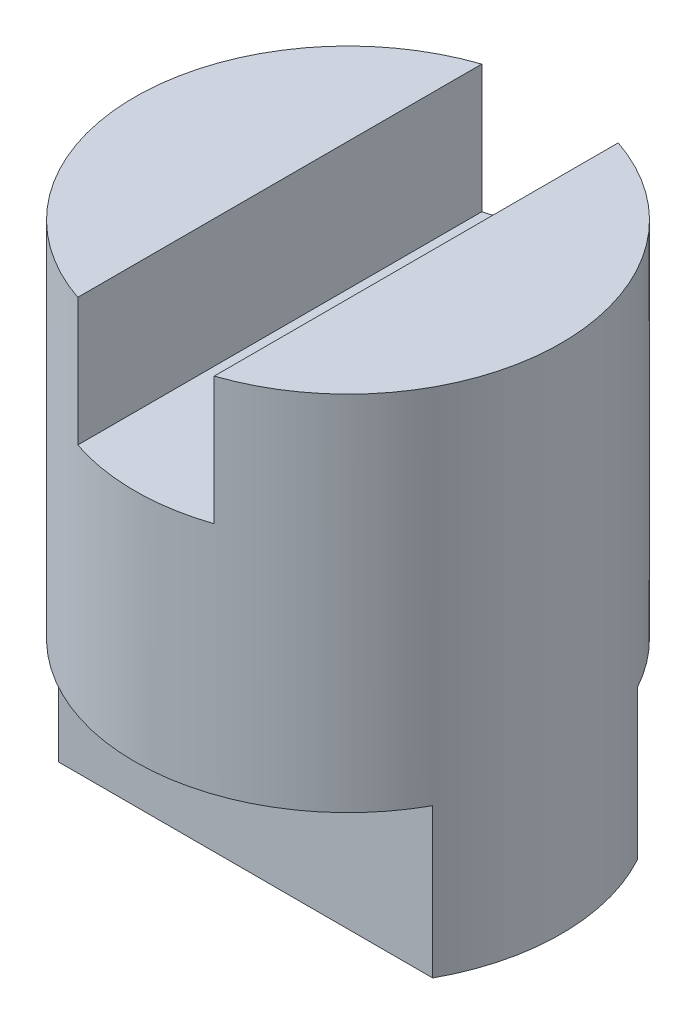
from build123d import *

# Parameters (mm, degrees)
SKETCH_1_R               = 50
EXTRUDE_1_DEPTH          = 120
CUT_EXTRUDE_1_DEPTH      = 140.283882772
CUT_EXTRUDE_1_DEPTH_BACK = 140.283882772
CUT_EXTRUDE_2_DEPTH      = 140.283882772
CUT_EXTRUDE_2_DEPTH_BACK = 140.283882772


with BuildPart() as part:
    # Sketch 1 → Extrude 1 (new body)
    with BuildSketch(Plane(origin=(0, 0, 0), x_dir=(1, 0, 0), z_dir=(0, 1, 0))):
        with Locations(Location((0, 0, 0), (0, 0, 270))):
            Circle(SKETCH_1_R)
    extrude(amount=EXTRUDE_1_DEPTH)

    # Sketch 2 → Cut-Extrude 1 (cut, two sides: drawn at the far end of the back side and taken through both)
    with BuildSketch(Plane.XY.offset(-CUT_EXTRUDE_1_DEPTH_BACK)):
        Polygon((0, 119.867289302), (-16, 120), (-16, 90), (16, 90), (16, 120), align=None)
    extrude(amount=CUT_EXTRUDE_1_DEPTH + CUT_EXTRUDE_1_DEPTH_BACK, mode=Mode.SUBTRACT)


with BuildPart() as body_2:
    # of the pieces the cut leaves, the one that is kept (cut_extrude_1_keep)
    add(part.part.solids().sort_by_distance((0, 90, 50))[0])

    # Sketch 3 → Cut-Extrude 2 (cut, two sides: drawn at the far end of the back side and taken through both)
    with BuildSketch(Plane(origin=(0, 0, 0), x_dir=(0, 0, -1), z_dir=(1, 0, 0)).offset(-CUT_EXTRUDE_2_DEPTH_BACK)):
        Polygon((-24, 0), (-24, 35), (-65.064488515, 35), (-65.064488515, -21.921073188), (-24, -21.921073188), align=None)
        Polygon((65.064488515, -21.921073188), (24, -21.921073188), (24, 0), (24, 35), (65.064488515, 35), align=None)
    extrude(amount=CUT_EXTRUDE_2_DEPTH + CUT_EXTRUDE_2_DEPTH_BACK, mode=Mode.SUBTRACT)


solid = body_2.part
